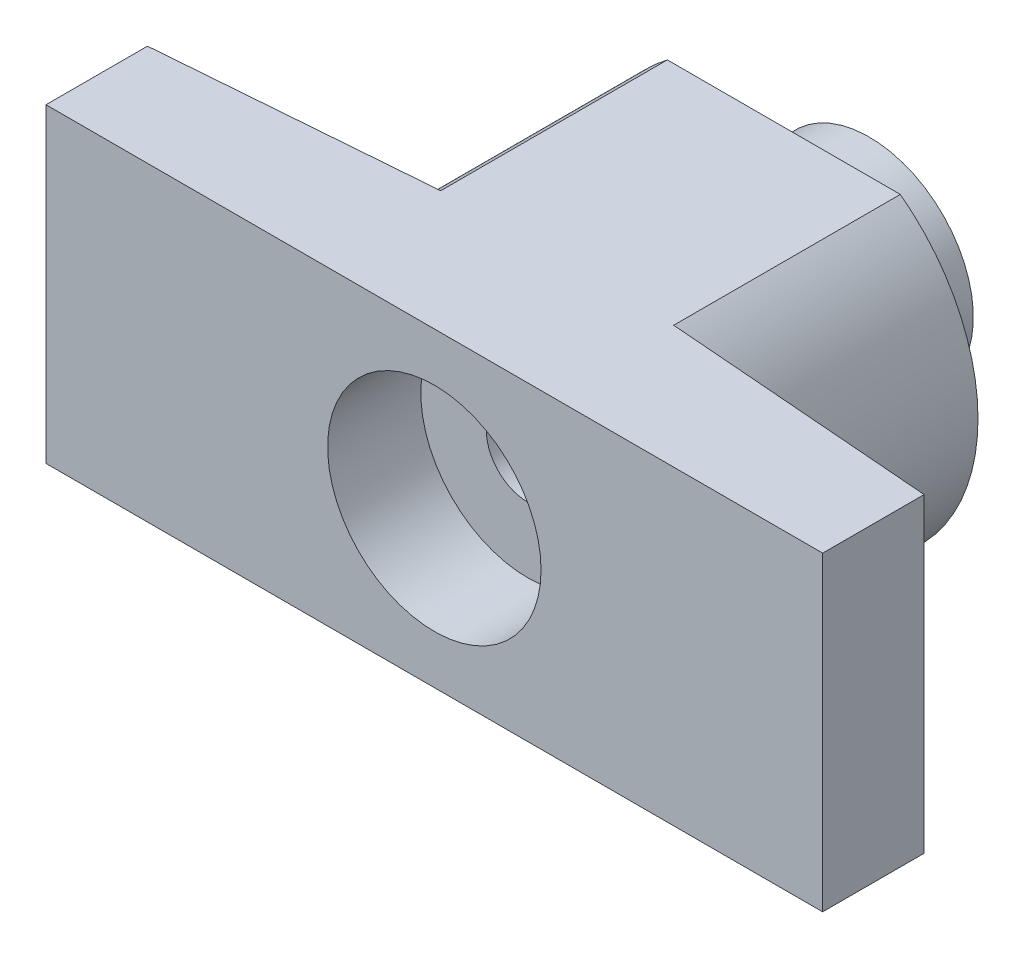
ISO-10303-21;
HEADER;
FILE_DESCRIPTION(('STEP AP214'),'2;1');
FILE_NAME('part.step','',(''),(''),'','','');
FILE_SCHEMA(('AUTOMOTIVE_DESIGN { 1 0 10303 214 1 1 1 1 }'));
ENDSEC;
DATA;
#1=APPLICATION_CONTEXT('core data for automotive mechanical design processes');
#2=APPLICATION_PROTOCOL_DEFINITION('international standard','automotive_design',2000,#1);
#3=PRODUCT_CONTEXT('',#1,'mechanical');
#4=PRODUCT('Part','Part','',(#3));
#5=PRODUCT_RELATED_PRODUCT_CATEGORY('part','',(#4));
#6=PRODUCT_DEFINITION_FORMATION('','',#4);
#7=PRODUCT_DEFINITION_CONTEXT('part definition',#1,'design');
#8=PRODUCT_DEFINITION('design','',#6,#7);
#9=PRODUCT_DEFINITION_SHAPE('','',#8);
#10=(LENGTH_UNIT() NAMED_UNIT(*) SI_UNIT(.MILLI.,.METRE.));
#11=(NAMED_UNIT(*) PLANE_ANGLE_UNIT() SI_UNIT($,.RADIAN.));
#12=(NAMED_UNIT(*) SI_UNIT($,.STERADIAN.) SOLID_ANGLE_UNIT());
#13=UNCERTAINTY_MEASURE_WITH_UNIT(LENGTH_MEASURE(1.E-05),#10,'distance_accuracy_value','');
#14=(GEOMETRIC_REPRESENTATION_CONTEXT(3) GLOBAL_UNCERTAINTY_ASSIGNED_CONTEXT((#13)) GLOBAL_UNIT_ASSIGNED_CONTEXT((#10,
#11,#12)) REPRESENTATION_CONTEXT('',''));
#15=CARTESIAN_POINT('',(0.,0.,0.));
#16=DIRECTION('',(0.,0.,1.));
#17=DIRECTION('',(1.,0.,0.));
#18=AXIS2_PLACEMENT_3D('',#15,#16,#17);
#19=CARTESIAN_POINT('',(0.,0.,10.795));
#20=DIRECTION('',(0.,0.,-1.));
#21=DIRECTION('',(-1.,0.,0.));
#22=AXIS2_PLACEMENT_3D('',#19,#20,#21);
#23=CYLINDRICAL_SURFACE('',#22,3.3655);
#24=CARTESIAN_POINT('',(0.,0.,-24.765));
#25=DIRECTION('',(0.,0.,-1.));
#26=DIRECTION('',(-1.,0.,0.));
#27=AXIS2_PLACEMENT_3D('',#24,#25,#26);
#28=CIRCLE('',#27,3.3655);
#29=CARTESIAN_POINT('',(-3.3655,0.,-24.765));
#30=VERTEX_POINT('',#29);
#31=EDGE_CURVE('E334',#30,#30,#28,.T.);
#32=CARTESIAN_POINT('',(0.,0.,3.175));
#33=DIRECTION('',(0.,0.,1.));
#34=DIRECTION('',(1.,0.,0.));
#35=AXIS2_PLACEMENT_3D('',#32,#33,#34);
#36=CIRCLE('',#35,3.3655);
#37=CARTESIAN_POINT('',(-3.3655,0.,3.175));
#38=VERTEX_POINT('',#37);
#39=EDGE_CURVE('E36',#38,#38,#36,.F.);
#40=CARTESIAN_POINT('',(-3.3655,0.,-24.765));
#41=CARTESIAN_POINT('',(-3.3655,0.,-24.4739583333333));
#42=CARTESIAN_POINT('',(-3.3655,0.,-24.1829166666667));
#43=CARTESIAN_POINT('',(-3.3655,0.,-23.6008333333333));
#44=CARTESIAN_POINT('',(-3.3655,0.,-23.3097916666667));
#45=CARTESIAN_POINT('',(-3.3655,0.,-22.7277083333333));
#46=CARTESIAN_POINT('',(-3.3655,0.,-22.4366666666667));
#47=CARTESIAN_POINT('',(-3.3655,0.,-21.8545833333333));
#48=CARTESIAN_POINT('',(-3.3655,0.,-21.5635416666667));
#49=CARTESIAN_POINT('',(-3.3655,0.,-20.9814583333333));
#50=CARTESIAN_POINT('',(-3.3655,0.,-20.6904166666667));
#51=CARTESIAN_POINT('',(-3.3655,0.,-20.1083333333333));
#52=CARTESIAN_POINT('',(-3.3655,0.,-19.8172916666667));
#53=CARTESIAN_POINT('',(-3.3655,0.,-19.2352083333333));
#54=CARTESIAN_POINT('',(-3.3655,0.,-18.9441666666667));
#55=CARTESIAN_POINT('',(-3.3655,0.,-18.3620833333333));
#56=CARTESIAN_POINT('',(-3.3655,0.,-18.0710416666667));
#57=CARTESIAN_POINT('',(-3.3655,0.,-17.4889583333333));
#58=CARTESIAN_POINT('',(-3.3655,0.,-17.1979166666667));
#59=CARTESIAN_POINT('',(-3.3655,0.,-16.6158333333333));
#60=CARTESIAN_POINT('',(-3.3655,0.,-16.3247916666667));
#61=CARTESIAN_POINT('',(-3.3655,0.,-15.7427083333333));
#62=CARTESIAN_POINT('',(-3.3655,0.,-15.4516666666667));
#63=CARTESIAN_POINT('',(-3.3655,0.,-14.8695833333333));
#64=CARTESIAN_POINT('',(-3.3655,0.,-14.5785416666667));
#65=CARTESIAN_POINT('',(-3.3655,0.,-13.9964583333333));
#66=CARTESIAN_POINT('',(-3.3655,0.,-13.7054166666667));
#67=CARTESIAN_POINT('',(-3.3655,0.,-13.1233333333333));
#68=CARTESIAN_POINT('',(-3.3655,0.,-12.8322916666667));
#69=CARTESIAN_POINT('',(-3.3655,0.,-12.2502083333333));
#70=CARTESIAN_POINT('',(-3.3655,0.,-11.9591666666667));
#71=CARTESIAN_POINT('',(-3.3655,0.,-11.3770833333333));
#72=CARTESIAN_POINT('',(-3.3655,0.,-11.0860416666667));
#73=CARTESIAN_POINT('',(-3.3655,0.,-10.5039583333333));
#74=CARTESIAN_POINT('',(-3.3655,0.,-10.2129166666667));
#75=CARTESIAN_POINT('',(-3.3655,0.,-9.63083333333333));
#76=CARTESIAN_POINT('',(-3.3655,0.,-9.33979166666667));
#77=CARTESIAN_POINT('',(-3.3655,0.,-8.75770833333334));
#78=CARTESIAN_POINT('',(-3.3655,0.,-8.46666666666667));
#79=CARTESIAN_POINT('',(-3.3655,0.,-7.88458333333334));
#80=CARTESIAN_POINT('',(-3.3655,0.,-7.59354166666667));
#81=CARTESIAN_POINT('',(-3.3655,0.,-7.01145833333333));
#82=CARTESIAN_POINT('',(-3.3655,0.,-6.72041666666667));
#83=CARTESIAN_POINT('',(-3.3655,0.,-6.13833333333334));
#84=CARTESIAN_POINT('',(-3.3655,0.,-5.84729166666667));
#85=CARTESIAN_POINT('',(-3.3655,0.,-5.26520833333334));
#86=CARTESIAN_POINT('',(-3.3655,0.,-4.97416666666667));
#87=CARTESIAN_POINT('',(-3.3655,0.,-4.39208333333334));
#88=CARTESIAN_POINT('',(-3.3655,0.,-4.10104166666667));
#89=CARTESIAN_POINT('',(-3.3655,0.,-3.51895833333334));
#90=CARTESIAN_POINT('',(-3.3655,0.,-3.22791666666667));
#91=CARTESIAN_POINT('',(-3.3655,0.,-2.64583333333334));
#92=CARTESIAN_POINT('',(-3.3655,0.,-2.35479166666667));
#93=CARTESIAN_POINT('',(-3.3655,0.,-1.77270833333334));
#94=CARTESIAN_POINT('',(-3.3655,0.,-1.48166666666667));
#95=CARTESIAN_POINT('',(-3.3655,0.,-0.899583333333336));
#96=CARTESIAN_POINT('',(-3.3655,0.,-0.60854166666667));
#97=CARTESIAN_POINT('',(-3.3655,0.,-0.0264583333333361));
#98=CARTESIAN_POINT('',(-3.3655,0.,0.264583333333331));
#99=CARTESIAN_POINT('',(-3.3655,0.,0.846666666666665));
#100=CARTESIAN_POINT('',(-3.3655,0.,1.13770833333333));
#101=CARTESIAN_POINT('',(-3.3655,0.,1.71979166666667));
#102=CARTESIAN_POINT('',(-3.3655,0.,2.01083333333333));
#103=CARTESIAN_POINT('',(-3.3655,0.,2.59291666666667));
#104=CARTESIAN_POINT('',(-3.3655,0.,2.88395833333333));
#105=CARTESIAN_POINT('',(-3.3655,0.,3.175));
#106=B_SPLINE_CURVE_WITH_KNOTS('',3,(#40,#41,#42,#43,#44,#45,#46,#47,#48,#49,#50,#51,#52,#53,
#54,#55,#56,#57,#58,#59,#60,#61,#62,#63,#64,#65,#66,#67,#68,#69,#70,#71,#72,#73,#74,#75,#76,#77,
#78,#79,#80,#81,#82,#83,#84,#85,#86,#87,#88,#89,#90,#91,#92,#93,#94,#95,#96,#97,#98,#99,#100,
#101,#102,#103,#104,#105),.UNSPECIFIED.,.F.,.F.,(4,2,2,2,2,2,2,2,2,2,2,2,2,2,2,2,2,2,2,2,2,2,2,
2,2,2,2,2,2,2,2,2,4),(0.,0.873125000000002,1.74625,2.619375,3.4925,4.365625,5.23875,6.111875,
6.985,7.858125,8.73125,9.604375,10.4775,11.350625,12.22375,13.096875,13.97,14.843125,15.71625,
16.589375,17.4625,18.335625,19.20875,20.081875,20.955,21.828125,22.70125,23.574375,24.4475,
25.320625,26.19375,27.066875,27.94),.UNSPECIFIED.);
#107=EDGE_CURVE('BSEAM32',#30,#38,#106,.T.);
#108=ORIENTED_EDGE('',*,*,#31,.T.);
#109=ORIENTED_EDGE('',*,*,#39,.F.);
#110=ORIENTED_EDGE('',*,*,#107,.T.);
#111=ORIENTED_EDGE('',*,*,#107,.F.);
#112=EDGE_LOOP('',(#108,#110,#109,#111));
#113=FACE_BOUND('',#112,.T.);
#114=ADVANCED_FACE('F32',(#113),#23,.F.);
#115=CARTESIAN_POINT('',(0.,0.,-17.78));
#116=DIRECTION('',(0.,0.,1.));
#117=DIRECTION('',(1.,0.,0.));
#118=AXIS2_PLACEMENT_3D('',#115,#116,#117);
#119=PLANE('',#118);
#120=CARTESIAN_POINT('',(0.,0.,-17.78));
#121=DIRECTION('',(0.,0.,1.));
#122=DIRECTION('',(1.,0.,0.));
#123=AXIS2_PLACEMENT_3D('',#120,#121,#122);
#124=CIRCLE('',#123,15.875);
#125=CARTESIAN_POINT('',(-9.525,12.7,-17.78));
#126=VERTEX_POINT('',#125);
#127=CARTESIAN_POINT('',(-9.52499999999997,-12.7,-17.78));
#128=VERTEX_POINT('',#127);
#129=EDGE_CURVE('E109',#126,#128,#124,.T.);
#130=ORIENTED_EDGE('',*,*,#129,.F.);
#131=DIRECTION('',(1.,0.,0.));
#132=VECTOR('',#131,1.);
#133=CARTESIAN_POINT('',(-9.525,12.7,-17.78));
#134=LINE('',#133,#132);
#135=CARTESIAN_POINT('',(9.525,12.7,-17.78));
#136=VERTEX_POINT('',#135);
#137=EDGE_CURVE('E106',#126,#136,#134,.T.);
#138=ORIENTED_EDGE('',*,*,#137,.T.);
#139=CARTESIAN_POINT('',(0.,0.,-17.78));
#140=DIRECTION('',(0.,0.,1.));
#141=DIRECTION('',(1.,0.,0.));
#142=AXIS2_PLACEMENT_3D('',#139,#140,#141);
#143=CIRCLE('',#142,15.875);
#144=CARTESIAN_POINT('',(9.52499999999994,-12.7,-17.78));
#145=VERTEX_POINT('',#144);
#146=EDGE_CURVE('E121',#145,#136,#143,.T.);
#147=ORIENTED_EDGE('',*,*,#146,.F.);
#148=DIRECTION('',(1.,0.,0.));
#149=VECTOR('',#148,1.);
#150=CARTESIAN_POINT('',(-9.52499999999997,-12.7,-17.78));
#151=LINE('',#150,#149);
#152=EDGE_CURVE('E100',#128,#145,#151,.T.);
#153=ORIENTED_EDGE('',*,*,#152,.F.);
#154=EDGE_LOOP('',(#130,#138,#147,#153));
#155=FACE_BOUND('',#154,.T.);
#156=CARTESIAN_POINT('',(0.,0.,-17.78));
#157=DIRECTION('',(0.,0.,-1.));
#158=DIRECTION('',(-1.,0.,0.));
#159=AXIS2_PLACEMENT_3D('',#156,#157,#158);
#160=CIRCLE('',#159,8.509);
#161=CARTESIAN_POINT('',(-8.509,0.,-17.78));
#162=VERTEX_POINT('',#161);
#163=EDGE_CURVE('E11',#162,#162,#160,.T.);
#164=ORIENTED_EDGE('',*,*,#163,.F.);
#165=EDGE_LOOP('',(#164));
#166=FACE_BOUND('',#165,.T.);
#167=ADVANCED_FACE('F118',(#155,#166),#119,.F.);
#168=CARTESIAN_POINT('',(31.75,-12.7,10.795));
#169=DIRECTION('',(0.,-1.,0.));
#170=DIRECTION('',(1.,0.,0.));
#171=AXIS2_PLACEMENT_3D('',#168,#169,#170);
#172=PLANE('',#171);
#173=DIRECTION('',(-1.,0.,0.));
#174=VECTOR('',#173,1.);
#175=CARTESIAN_POINT('',(31.75,-12.7,10.795));
#176=LINE('',#175,#174);
#177=CARTESIAN_POINT('',(31.75,-12.7,10.795));
#178=VERTEX_POINT('',#177);
#179=CARTESIAN_POINT('',(-31.75,-12.7,10.795));
#180=VERTEX_POINT('',#179);
#181=EDGE_CURVE('E147',#178,#180,#176,.T.);
#182=ORIENTED_EDGE('',*,*,#181,.T.);
#183=DIRECTION('',(0.,0.,-1.));
#184=VECTOR('',#183,1.);
#185=CARTESIAN_POINT('',(-31.75,-12.7,10.795));
#186=LINE('',#185,#184);
#187=CARTESIAN_POINT('',(-31.75,-12.7,2.49877919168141));
#188=VERTEX_POINT('',#187);
#189=EDGE_CURVE('E161',#180,#188,#186,.T.);
#190=ORIENTED_EDGE('',*,*,#189,.T.);
#191=DIRECTION('',(-0.996917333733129,0.,0.078459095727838));
#192=VECTOR('',#191,1.);
#193=CARTESIAN_POINT('',(0.,-12.7,0.));
#194=LINE('',#193,#192);
#195=CARTESIAN_POINT('',(-9.52499999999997,-12.7,0.749633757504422));
#196=VERTEX_POINT('',#195);
#197=EDGE_CURVE('E103',#196,#188,#194,.T.);
#198=ORIENTED_EDGE('',*,*,#197,.F.);
#199=DIRECTION('',(0.,0.,1.));
#200=VECTOR('',#199,1.);
#201=CARTESIAN_POINT('',(-9.52499999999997,-12.7,-17.78));
#202=LINE('',#201,#200);
#203=EDGE_CURVE('E97',#128,#196,#202,.T.);
#204=ORIENTED_EDGE('',*,*,#203,.F.);
#205=ORIENTED_EDGE('',*,*,#152,.T.);
#206=DIRECTION('',(0.,0.,1.));
#207=VECTOR('',#206,1.);
#208=CARTESIAN_POINT('',(9.52499999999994,-12.7,-17.78));
#209=LINE('',#208,#207);
#210=CARTESIAN_POINT('',(9.52499999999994,-12.7,0.749633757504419));
#211=VERTEX_POINT('',#210);
#212=EDGE_CURVE('E49',#145,#211,#209,.T.);
#213=ORIENTED_EDGE('',*,*,#212,.T.);
#214=DIRECTION('',(0.996917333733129,0.,0.078459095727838));
#215=VECTOR('',#214,1.);
#216=CARTESIAN_POINT('',(0.,-12.7,0.));
#217=LINE('',#216,#215);
#218=CARTESIAN_POINT('',(31.75,-12.7,2.49877919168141));
#219=VERTEX_POINT('',#218);
#220=EDGE_CURVE('E132',#211,#219,#217,.T.);
#221=ORIENTED_EDGE('',*,*,#220,.T.);
#222=DIRECTION('',(0.,0.,-1.));
#223=VECTOR('',#222,1.);
#224=CARTESIAN_POINT('',(31.75,-12.7,10.795));
#225=LINE('',#224,#223);
#226=EDGE_CURVE('E158',#178,#219,#225,.T.);
#227=ORIENTED_EDGE('',*,*,#226,.F.);
#228=EDGE_LOOP('',(#182,#190,#198,#204,#205,#213,#221,#227));
#229=FACE_BOUND('',#228,.T.);
#230=ADVANCED_FACE('F34',(#229),#172,.T.);
#231=CARTESIAN_POINT('',(31.75,-12.7,10.795));
#232=DIRECTION('',(-1.,0.,0.));
#233=DIRECTION('',(0.,0.,1.));
#234=AXIS2_PLACEMENT_3D('',#231,#232,#233);
#235=PLANE('',#234);
#236=DIRECTION('',(0.,-1.,0.));
#237=VECTOR('',#236,1.);
#238=CARTESIAN_POINT('',(31.75,-12.7,2.49877919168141));
#239=LINE('',#238,#237);
#240=CARTESIAN_POINT('',(31.75,12.7,2.49877919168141));
#241=VERTEX_POINT('',#240);
#242=EDGE_CURVE('E138',#241,#219,#239,.T.);
#243=ORIENTED_EDGE('',*,*,#242,.F.);
#244=DIRECTION('',(0.,0.,-1.));
#245=VECTOR('',#244,1.);
#246=CARTESIAN_POINT('',(31.75,12.7,10.795));
#247=LINE('',#246,#245);
#248=CARTESIAN_POINT('',(31.75,12.7,10.795));
#249=VERTEX_POINT('',#248);
#250=EDGE_CURVE('E155',#249,#241,#247,.T.);
#251=ORIENTED_EDGE('',*,*,#250,.F.);
#252=DIRECTION('',(0.,1.,0.));
#253=VECTOR('',#252,1.);
#254=CARTESIAN_POINT('',(31.75,-12.7,10.795));
#255=LINE('',#254,#253);
#256=EDGE_CURVE('E149',#178,#249,#255,.T.);
#257=ORIENTED_EDGE('',*,*,#256,.F.);
#258=ORIENTED_EDGE('',*,*,#226,.T.);
#259=EDGE_LOOP('',(#243,#251,#257,#258));
#260=FACE_BOUND('',#259,.T.);
#261=ADVANCED_FACE('F185',(#260),#235,.F.);
#262=CARTESIAN_POINT('',(-31.75,12.7,10.795));
#263=DIRECTION('',(0.,1.,0.));
#264=DIRECTION('',(0.,0.,1.));
#265=AXIS2_PLACEMENT_3D('',#262,#263,#264);
#266=PLANE('',#265);
#267=DIRECTION('',(0.996917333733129,0.,0.078459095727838));
#268=VECTOR('',#267,1.);
#269=CARTESIAN_POINT('',(0.,12.7,0.));
#270=LINE('',#269,#268);
#271=CARTESIAN_POINT('',(9.525,12.7,0.749633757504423));
#272=VERTEX_POINT('',#271);
#273=EDGE_CURVE('E136',#272,#241,#270,.T.);
#274=ORIENTED_EDGE('',*,*,#273,.F.);
#275=DIRECTION('',(0.,0.,1.));
#276=VECTOR('',#275,1.);
#277=CARTESIAN_POINT('',(9.525,12.7,-17.78));
#278=LINE('',#277,#276);
#279=EDGE_CURVE('E128',#136,#272,#278,.T.);
#280=ORIENTED_EDGE('',*,*,#279,.F.);
#281=ORIENTED_EDGE('',*,*,#137,.F.);
#282=DIRECTION('',(0.,0.,1.));
#283=VECTOR('',#282,1.);
#284=CARTESIAN_POINT('',(-9.525,12.7,-17.78));
#285=LINE('',#284,#283);
#286=CARTESIAN_POINT('',(-9.525,12.7,0.749633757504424));
#287=VERTEX_POINT('',#286);
#288=EDGE_CURVE('E112',#126,#287,#285,.T.);
#289=ORIENTED_EDGE('',*,*,#288,.T.);
#290=DIRECTION('',(-0.996917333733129,0.,0.078459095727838));
#291=VECTOR('',#290,1.);
#292=CARTESIAN_POINT('',(0.,12.7,0.));
#293=LINE('',#292,#291);
#294=CARTESIAN_POINT('',(-31.75,12.7,2.49877919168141));
#295=VERTEX_POINT('',#294);
#296=EDGE_CURVE('E134',#287,#295,#293,.T.);
#297=ORIENTED_EDGE('',*,*,#296,.T.);
#298=DIRECTION('',(0.,0.,-1.));
#299=VECTOR('',#298,1.);
#300=CARTESIAN_POINT('',(-31.75,12.7,10.795));
#301=LINE('',#300,#299);
#302=CARTESIAN_POINT('',(-31.75,12.7,10.795));
#303=VERTEX_POINT('',#302);
#304=EDGE_CURVE('E57',#303,#295,#301,.T.);
#305=ORIENTED_EDGE('',*,*,#304,.F.);
#306=DIRECTION('',(1.,0.,0.));
#307=VECTOR('',#306,1.);
#308=CARTESIAN_POINT('',(-31.75,12.7,10.795));
#309=LINE('',#308,#307);
#310=EDGE_CURVE('E152',#303,#249,#309,.T.);
#311=ORIENTED_EDGE('',*,*,#310,.T.);
#312=ORIENTED_EDGE('',*,*,#250,.T.);
#313=EDGE_LOOP('',(#274,#280,#281,#289,#297,#305,#311,#312));
#314=FACE_BOUND('',#313,.T.);
#315=ADVANCED_FACE('F169',(#314),#266,.T.);
#316=CARTESIAN_POINT('',(-31.75,12.7,10.795));
#317=DIRECTION('',(1.,0.,0.));
#318=DIRECTION('',(0.,0.,-1.));
#319=AXIS2_PLACEMENT_3D('',#316,#317,#318);
#320=PLANE('',#319);
#321=ORIENTED_EDGE('',*,*,#304,.T.);
#322=DIRECTION('',(0.,-1.,0.));
#323=VECTOR('',#322,1.);
#324=CARTESIAN_POINT('',(-31.75,12.7,2.49877919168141));
#325=LINE('',#324,#323);
#326=EDGE_CURVE('E141',#295,#188,#325,.T.);
#327=ORIENTED_EDGE('',*,*,#326,.T.);
#328=ORIENTED_EDGE('',*,*,#189,.F.);
#329=DIRECTION('',(0.,-1.,0.));
#330=VECTOR('',#329,1.);
#331=CARTESIAN_POINT('',(-31.75,12.7,10.795));
#332=LINE('',#331,#330);
#333=EDGE_CURVE('E144',#303,#180,#332,.T.);
#334=ORIENTED_EDGE('',*,*,#333,.F.);
#335=EDGE_LOOP('',(#321,#327,#328,#334));
#336=FACE_BOUND('',#335,.T.);
#337=ADVANCED_FACE('F191',(#336),#320,.F.);
#338=CARTESIAN_POINT('',(-31.75,12.7,10.795));
#339=DIRECTION('',(0.,0.,1.));
#340=DIRECTION('',(1.,0.,0.));
#341=AXIS2_PLACEMENT_3D('',#338,#339,#340);
#342=PLANE('',#341);
#343=CARTESIAN_POINT('',(0.,0.,10.795));
#344=DIRECTION('',(0.,0.,1.));
#345=DIRECTION('',(1.,0.,0.));
#346=AXIS2_PLACEMENT_3D('',#343,#344,#345);
#347=CIRCLE('',#346,8.7249);
#348=CARTESIAN_POINT('',(8.7249,0.,10.795));
#349=VERTEX_POINT('',#348);
#350=EDGE_CURVE('E330',#349,#349,#347,.T.);
#351=ORIENTED_EDGE('',*,*,#350,.F.);
#352=EDGE_LOOP('',(#351));
#353=FACE_BOUND('',#352,.T.);
#354=ORIENTED_EDGE('',*,*,#256,.T.);
#355=ORIENTED_EDGE('',*,*,#310,.F.);
#356=ORIENTED_EDGE('',*,*,#333,.T.);
#357=ORIENTED_EDGE('',*,*,#181,.F.);
#358=EDGE_LOOP('',(#354,#355,#356,#357));
#359=FACE_BOUND('',#358,.T.);
#360=ADVANCED_FACE('F182',(#353,#359),#342,.T.);
#361=CARTESIAN_POINT('',(0.,12.7,0.));
#362=DIRECTION('',(0.078459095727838,0.,0.996917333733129));
#363=DIRECTION('',(0.996917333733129,0.,-0.078459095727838));
#364=AXIS2_PLACEMENT_3D('',#361,#362,#363);
#365=PLANE('',#364);
#366=ORIENTED_EDGE('',*,*,#296,.F.);
#367=CARTESIAN_POINT('',(0.,0.,0.));
#368=DIRECTION('',(0.078459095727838,0.,0.996917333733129));
#369=DIRECTION('',(-0.996917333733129,0.,0.078459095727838));
#370=AXIS2_PLACEMENT_3D('',#367,#368,#369);
#371=ELLIPSE('',#370,15.9240886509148,15.875);
#372=EDGE_CURVE('E41',#287,#196,#371,.T.);
#373=ORIENTED_EDGE('',*,*,#372,.T.);
#374=ORIENTED_EDGE('',*,*,#197,.T.);
#375=ORIENTED_EDGE('',*,*,#326,.F.);
#376=EDGE_LOOP('',(#366,#373,#374,#375));
#377=FACE_BOUND('',#376,.T.);
#378=ADVANCED_FACE('F166',(#377),#365,.F.);
#379=CARTESIAN_POINT('',(0.,12.7,0.));
#380=DIRECTION('',(0.078459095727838,0.,-0.996917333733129));
#381=DIRECTION('',(-0.996917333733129,0.,-0.078459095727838));
#382=AXIS2_PLACEMENT_3D('',#379,#380,#381);
#383=PLANE('',#382);
#384=CARTESIAN_POINT('',(0.,0.,0.));
#385=DIRECTION('',(0.078459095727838,0.,-0.996917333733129));
#386=DIRECTION('',(0.996917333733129,0.,0.078459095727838));
#387=AXIS2_PLACEMENT_3D('',#384,#385,#386);
#388=ELLIPSE('',#387,15.9240886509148,15.875);
#389=EDGE_CURVE('E163',#272,#211,#388,.T.);
#390=ORIENTED_EDGE('',*,*,#389,.F.);
#391=ORIENTED_EDGE('',*,*,#273,.T.);
#392=ORIENTED_EDGE('',*,*,#242,.T.);
#393=ORIENTED_EDGE('',*,*,#220,.F.);
#394=EDGE_LOOP('',(#390,#391,#392,#393));
#395=FACE_BOUND('',#394,.T.);
#396=ADVANCED_FACE('F175',(#395),#383,.T.);
#397=CARTESIAN_POINT('',(0.,0.,-17.78));
#398=DIRECTION('',(0.,0.,1.));
#399=DIRECTION('',(1.,0.,0.));
#400=AXIS2_PLACEMENT_3D('',#397,#398,#399);
#401=CYLINDRICAL_SURFACE('',#400,15.875);
#402=ORIENTED_EDGE('',*,*,#372,.F.);
#403=ORIENTED_EDGE('',*,*,#288,.F.);
#404=ORIENTED_EDGE('',*,*,#129,.T.);
#405=ORIENTED_EDGE('',*,*,#203,.T.);
#406=EDGE_LOOP('',(#402,#403,#404,#405));
#407=FACE_BOUND('',#406,.T.);
#408=ADVANCED_FACE('F110',(#407),#401,.T.);
#409=CARTESIAN_POINT('',(0.,0.,-17.78));
#410=DIRECTION('',(0.,0.,1.));
#411=DIRECTION('',(1.,0.,0.));
#412=AXIS2_PLACEMENT_3D('',#409,#410,#411);
#413=CYLINDRICAL_SURFACE('',#412,15.875);
#414=ORIENTED_EDGE('',*,*,#279,.T.);
#415=ORIENTED_EDGE('',*,*,#389,.T.);
#416=ORIENTED_EDGE('',*,*,#212,.F.);
#417=ORIENTED_EDGE('',*,*,#146,.T.);
#418=EDGE_LOOP('',(#414,#415,#416,#417));
#419=FACE_BOUND('',#418,.T.);
#420=ADVANCED_FACE('F172',(#419),#413,.T.);
#421=CARTESIAN_POINT('',(0.,0.,-24.765));
#422=DIRECTION('',(0.,0.,1.));
#423=DIRECTION('',(1.,0.,0.));
#424=AXIS2_PLACEMENT_3D('',#421,#422,#423);
#425=CYLINDRICAL_SURFACE('',#424,8.509);
#426=CARTESIAN_POINT('',(0.,0.,-24.765));
#427=DIRECTION('',(0.,0.,-1.));
#428=DIRECTION('',(-1.,0.,0.));
#429=AXIS2_PLACEMENT_3D('',#426,#427,#428);
#430=CIRCLE('',#429,8.509);
#431=CARTESIAN_POINT('',(-8.509,0.,-24.765));
#432=VERTEX_POINT('',#431);
#433=EDGE_CURVE('E116',#432,#432,#430,.T.);
#434=ORIENTED_EDGE('',*,*,#433,.F.);
#435=EDGE_LOOP('',(#434));
#436=FACE_BOUND('',#435,.T.);
#437=ORIENTED_EDGE('',*,*,#163,.T.);
#438=EDGE_LOOP('',(#437));
#439=FACE_BOUND('',#438,.T.);
#440=ADVANCED_FACE('F210',(#436,#439),#425,.T.);
#441=CARTESIAN_POINT('',(0.,0.,-24.765));
#442=DIRECTION('',(0.,0.,-1.));
#443=DIRECTION('',(-1.,0.,0.));
#444=AXIS2_PLACEMENT_3D('',#441,#442,#443);
#445=PLANE('',#444);
#446=ORIENTED_EDGE('',*,*,#31,.F.);
#447=EDGE_LOOP('',(#446));
#448=FACE_BOUND('',#447,.T.);
#449=ORIENTED_EDGE('',*,*,#433,.T.);
#450=EDGE_LOOP('',(#449));
#451=FACE_BOUND('',#450,.T.);
#452=ADVANCED_FACE('F206',(#448,#451),#445,.T.);
#453=CARTESIAN_POINT('',(0.,0.,3.175));
#454=DIRECTION('',(0.,0.,1.));
#455=DIRECTION('',(1.,0.,0.));
#456=AXIS2_PLACEMENT_3D('',#453,#454,#455);
#457=PLANE('',#456);
#458=CARTESIAN_POINT('',(0.,0.,3.175));
#459=DIRECTION('',(0.,0.,1.));
#460=DIRECTION('',(1.,0.,0.));
#461=AXIS2_PLACEMENT_3D('',#458,#459,#460);
#462=CIRCLE('',#461,8.7249);
#463=CARTESIAN_POINT('',(8.7249,0.,3.175));
#464=VERTEX_POINT('',#463);
#465=EDGE_CURVE('E327',#464,#464,#462,.T.);
#466=ORIENTED_EDGE('',*,*,#465,.T.);
#467=EDGE_LOOP('',(#466));
#468=FACE_BOUND('',#467,.T.);
#469=ORIENTED_EDGE('',*,*,#39,.T.);
#470=EDGE_LOOP('',(#469));
#471=FACE_BOUND('',#470,.T.);
#472=ADVANCED_FACE('F209',(#468,#471),#457,.T.);
#473=CARTESIAN_POINT('',(0.,0.,3.175));
#474=DIRECTION('',(0.,0.,1.));
#475=DIRECTION('',(1.,0.,0.));
#476=AXIS2_PLACEMENT_3D('',#473,#474,#475);
#477=CYLINDRICAL_SURFACE('',#476,8.7249);
#478=CARTESIAN_POINT('',(8.7249,0.,3.175));
#479=CARTESIAN_POINT('',(8.7249,0.,3.254375));
#480=CARTESIAN_POINT('',(8.7249,0.,3.33375));
#481=CARTESIAN_POINT('',(8.7249,0.,3.4925));
#482=CARTESIAN_POINT('',(8.7249,0.,3.571875));
#483=CARTESIAN_POINT('',(8.7249,0.,3.730625));
#484=CARTESIAN_POINT('',(8.7249,0.,3.81));
#485=CARTESIAN_POINT('',(8.7249,0.,3.96875));
#486=CARTESIAN_POINT('',(8.7249,0.,4.048125));
#487=CARTESIAN_POINT('',(8.7249,0.,4.206875));
#488=CARTESIAN_POINT('',(8.7249,0.,4.28625));
#489=CARTESIAN_POINT('',(8.7249,0.,4.445));
#490=CARTESIAN_POINT('',(8.7249,0.,4.524375));
#491=CARTESIAN_POINT('',(8.7249,0.,4.683125));
#492=CARTESIAN_POINT('',(8.7249,0.,4.7625));
#493=CARTESIAN_POINT('',(8.7249,0.,4.92125));
#494=CARTESIAN_POINT('',(8.7249,0.,5.000625));
#495=CARTESIAN_POINT('',(8.7249,0.,5.159375));
#496=CARTESIAN_POINT('',(8.7249,0.,5.23875));
#497=CARTESIAN_POINT('',(8.7249,0.,5.3975));
#498=CARTESIAN_POINT('',(8.7249,0.,5.476875));
#499=CARTESIAN_POINT('',(8.7249,0.,5.635625));
#500=CARTESIAN_POINT('',(8.7249,0.,5.715));
#501=CARTESIAN_POINT('',(8.7249,0.,5.87375));
#502=CARTESIAN_POINT('',(8.7249,0.,5.953125));
#503=CARTESIAN_POINT('',(8.7249,0.,6.111875));
#504=CARTESIAN_POINT('',(8.7249,0.,6.19125));
#505=CARTESIAN_POINT('',(8.7249,0.,6.35));
#506=CARTESIAN_POINT('',(8.7249,0.,6.429375));
#507=CARTESIAN_POINT('',(8.7249,0.,6.588125));
#508=CARTESIAN_POINT('',(8.7249,0.,6.6675));
#509=CARTESIAN_POINT('',(8.7249,0.,6.82625));
#510=CARTESIAN_POINT('',(8.7249,0.,6.905625));
#511=CARTESIAN_POINT('',(8.7249,0.,7.064375));
#512=CARTESIAN_POINT('',(8.7249,0.,7.14375));
#513=CARTESIAN_POINT('',(8.7249,0.,7.3025));
#514=CARTESIAN_POINT('',(8.7249,0.,7.381875));
#515=CARTESIAN_POINT('',(8.7249,0.,7.540625));
#516=CARTESIAN_POINT('',(8.7249,0.,7.62));
#517=CARTESIAN_POINT('',(8.7249,0.,7.77875));
#518=CARTESIAN_POINT('',(8.7249,0.,7.858125));
#519=CARTESIAN_POINT('',(8.7249,0.,8.016875));
#520=CARTESIAN_POINT('',(8.7249,0.,8.09625));
#521=CARTESIAN_POINT('',(8.7249,0.,8.255));
#522=CARTESIAN_POINT('',(8.7249,0.,8.334375));
#523=CARTESIAN_POINT('',(8.7249,0.,8.493125));
#524=CARTESIAN_POINT('',(8.7249,0.,8.5725));
#525=CARTESIAN_POINT('',(8.7249,0.,8.73125));
#526=CARTESIAN_POINT('',(8.7249,0.,8.810625));
#527=CARTESIAN_POINT('',(8.7249,0.,8.969375));
#528=CARTESIAN_POINT('',(8.7249,0.,9.04875));
#529=CARTESIAN_POINT('',(8.7249,0.,9.2075));
#530=CARTESIAN_POINT('',(8.7249,0.,9.286875));
#531=CARTESIAN_POINT('',(8.7249,0.,9.445625));
#532=CARTESIAN_POINT('',(8.7249,0.,9.525));
#533=CARTESIAN_POINT('',(8.7249,0.,9.68375));
#534=CARTESIAN_POINT('',(8.7249,0.,9.763125));
#535=CARTESIAN_POINT('',(8.7249,0.,9.921875));
#536=CARTESIAN_POINT('',(8.7249,0.,10.00125));
#537=CARTESIAN_POINT('',(8.7249,0.,10.16));
#538=CARTESIAN_POINT('',(8.7249,0.,10.239375));
#539=CARTESIAN_POINT('',(8.7249,0.,10.398125));
#540=CARTESIAN_POINT('',(8.7249,0.,10.4775));
#541=CARTESIAN_POINT('',(8.7249,0.,10.63625));
#542=CARTESIAN_POINT('',(8.7249,0.,10.715625));
#543=CARTESIAN_POINT('',(8.7249,0.,10.795));
#544=B_SPLINE_CURVE_WITH_KNOTS('',3,(#478,#479,#480,#481,#482,#483,#484,#485,#486,#487,#488,
#489,#490,#491,#492,#493,#494,#495,#496,#497,#498,#499,#500,#501,#502,#503,#504,#505,#506,#507,
#508,#509,#510,#511,#512,#513,#514,#515,#516,#517,#518,#519,#520,#521,#522,#523,#524,#525,#526,
#527,#528,#529,#530,#531,#532,#533,#534,#535,#536,#537,#538,#539,#540,#541,#542,#543),
.UNSPECIFIED.,.F.,.F.,(4,2,2,2,2,2,2,2,2,2,2,2,2,2,2,2,2,2,2,2,2,2,2,2,2,2,2,2,2,2,2,2,4),(0.,
0.238125,0.47625,0.714375,0.952499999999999,1.190625,1.42875,1.666875,1.905,2.143125,2.38125,
2.619375,2.8575,3.095625,3.33375,3.571875,3.81,4.048125,4.28625,4.524375,4.7625,5.000625,
5.23875,5.476875,5.715,5.953125,6.19125,6.429375,6.6675,6.905625,7.14375,7.381875,7.62),.UNSPECIFIED.);
#545=EDGE_CURVE('BSEAM204',#464,#349,#544,.T.);
#546=ORIENTED_EDGE('',*,*,#465,.F.);
#547=ORIENTED_EDGE('',*,*,#350,.T.);
#548=ORIENTED_EDGE('',*,*,#545,.T.);
#549=ORIENTED_EDGE('',*,*,#545,.F.);
#550=EDGE_LOOP('',(#546,#548,#547,#549));
#551=FACE_BOUND('',#550,.T.);
#552=ADVANCED_FACE('F204',(#551),#477,.F.);
#553=CLOSED_SHELL('',(#114,#167,#230,#261,#315,#337,#360,#378,#396,#408,#420,#440,#452,#472,#552));
#554=MANIFOLD_SOLID_BREP('B2',#553);
#555=ADVANCED_BREP_SHAPE_REPRESENTATION('',(#18,#554),#14);
#556=SHAPE_DEFINITION_REPRESENTATION(#9,#555);
ENDSEC;
END-ISO-10303-21;
